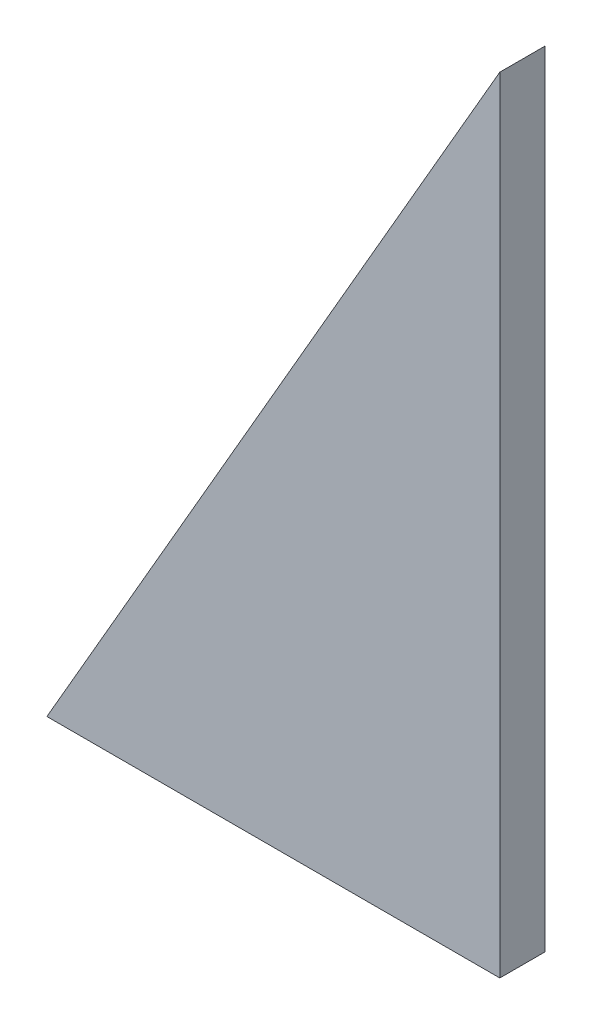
from build123d import *

# Parameters (mm, degrees)
DODANIE_WYCI_GNI_CIE1_DEPTH    = 8
OTW_R_GWINTOWANY_M5X0_81_D     = 4.2
OTW_R_GWINTOWANY_M5X0_81_DEPTH = 14
OTW_R_GWINTOWANY_M5X0_81_TIP   = 1.2618073
OTW_R_GWINTOWANY_M5X0_82_D     = 4.2
OTW_R_GWINTOWANY_M5X0_82_DEPTH = 14
OTW_R_GWINTOWANY_M5X0_82_TIP   = 1.2618073


with BuildPart() as part:
    # Szkic1 → Dodanie-wyci_gni_cie1 (new body)
    with BuildSketch(Plane.XY):
        Polygon((0, 0), (80, 0), (80, 138.564064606), align=None)
    extrude(amount=DODANIE_WYCI_GNI_CIE1_DEPTH)

    # Otw_r gwintowany M5x0.81
    with Locations(Plane(origin=(0, 0, 0), x_dir=(0, 0, 1), z_dir=(-0.8660254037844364, 0.5000000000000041, 0))):
        with Locations((4, 35), (4, 110)):
            Hole(OTW_R_GWINTOWANY_M5X0_81_D / 2, depth=OTW_R_GWINTOWANY_M5X0_81_DEPTH)
            with Locations((0, 0, -(OTW_R_GWINTOWANY_M5X0_81_DEPTH + OTW_R_GWINTOWANY_M5X0_81_TIP / 2))):  # 118° drill point
                Cone(0, OTW_R_GWINTOWANY_M5X0_81_D / 2, OTW_R_GWINTOWANY_M5X0_81_TIP, mode=Mode.SUBTRACT)

    # Otw_r gwintowany M5x0.82
    with Locations(Plane(origin=(0, 0, 0), x_dir=(-1, 0, 0), z_dir=(0, -1, 0))):
        with Locations((-23.5, -4), (-53.5, -4)):
            Hole(OTW_R_GWINTOWANY_M5X0_82_D / 2, depth=OTW_R_GWINTOWANY_M5X0_82_DEPTH)
            with Locations((0, 0, -(OTW_R_GWINTOWANY_M5X0_82_DEPTH + OTW_R_GWINTOWANY_M5X0_82_TIP / 2))):  # 118° drill point
                Cone(0, OTW_R_GWINTOWANY_M5X0_82_D / 2, OTW_R_GWINTOWANY_M5X0_82_TIP, mode=Mode.SUBTRACT)


solid = part.part
